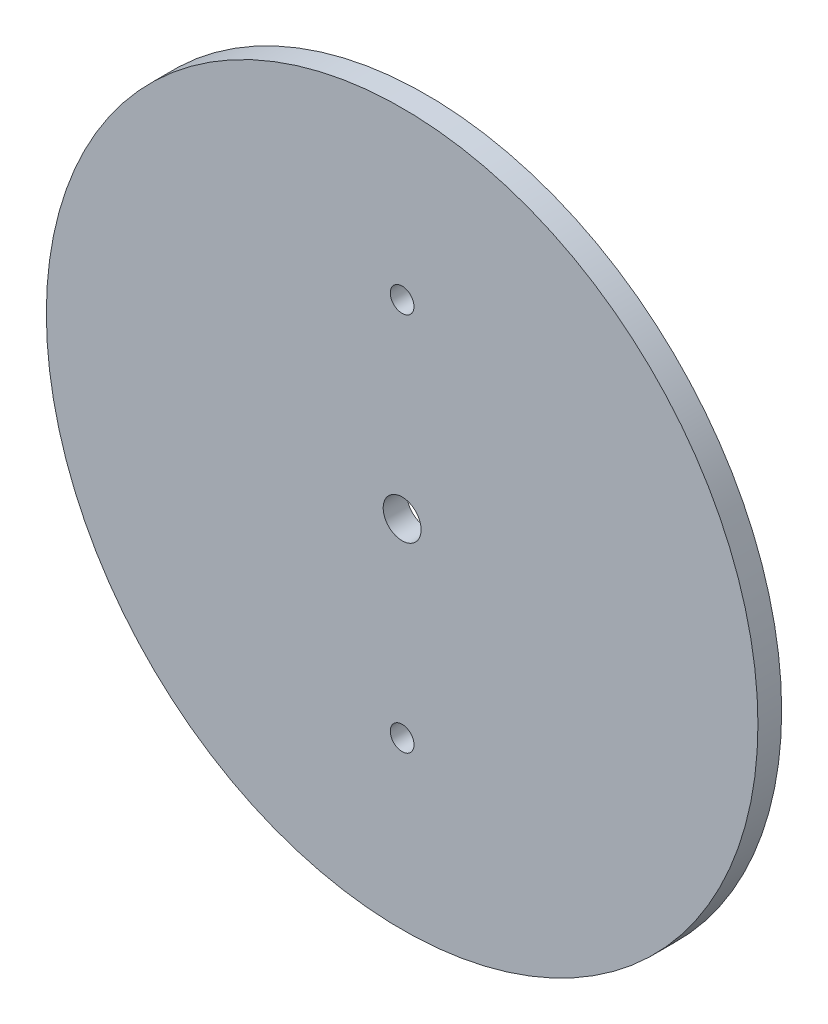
from build123d import *

# Parameters (mm, degrees)
SKETCH_1_R          = 4
EXTRUDE_1_DEPTH     = 70
SKETCH_2_R          = 75
EXTRUDE_2_DEPTH     = 5
EXTRUDE_START       = -30
SKETCH_5_R          = 45
EXTRUDE_3_DEPTH     = 5
SKETCH_6_R          = 2.5
CUT_EXTRUDE_1_DEPTH = 100
SKETCH_7_R          = 171.376015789
CUT_EXTRUDE_2_DEPTH = 120
SKETCH_9_R          = 4
CUT_EXTRUDE_3_DEPTH = 120


with BuildPart() as part:
    # Sketch 1 → Extrude 1 (new body)
    with BuildSketch(Plane.XY):
        Circle(SKETCH_1_R)
    extrude(amount=EXTRUDE_1_DEPTH)

    # Sketch 2 → Extrude 2 (add)
    with BuildSketch(Plane.XY.offset(70)):
        Circle(SKETCH_2_R)
    extrude(amount=-EXTRUDE_2_DEPTH)

    # Sketch 5 → Extrude 3 (add)
    with BuildSketch(Plane(origin=(0, 0, 0), x_dir=(-1, 0, 0), z_dir=(0, 0, -1)).offset(EXTRUDE_START)):
        Circle(SKETCH_5_R)
    extrude(amount=-EXTRUDE_3_DEPTH)

    # Sketch 6 → Cut-Extrude 1 (cut)
    with BuildSketch(Plane(origin=(0, 0, 30), x_dir=(-1, 0, 0), z_dir=(0, 0, -1))):
        with Locations((0, 40)):
            Circle(SKETCH_6_R)
    cut_extrude_1 = extrude(amount=-CUT_EXTRUDE_1_DEPTH, mode=Mode.SUBTRACT)

    # Mirror 1: Cut-Extrude 1 across plane
    add(cut_extrude_1.mirror(Plane.ZX), mode=Mode.SUBTRACT)

    # Sketch 7 → Cut-Extrude 2 (cut)
    with BuildSketch(Plane(origin=(0, 0, 65), x_dir=(-1, 0, 0), z_dir=(0, 0, -1))):
        Circle(SKETCH_7_R)
    extrude(amount=CUT_EXTRUDE_2_DEPTH, mode=Mode.SUBTRACT)

    # Sketch 9 → Cut-Extrude 3 (cut)
    with BuildSketch(Plane(origin=(0, 0, 65), x_dir=(-1, 0, 0), z_dir=(0, 0, -1))):
        Circle(SKETCH_9_R)
    extrude(amount=-CUT_EXTRUDE_3_DEPTH, mode=Mode.SUBTRACT)


solid = part.part
